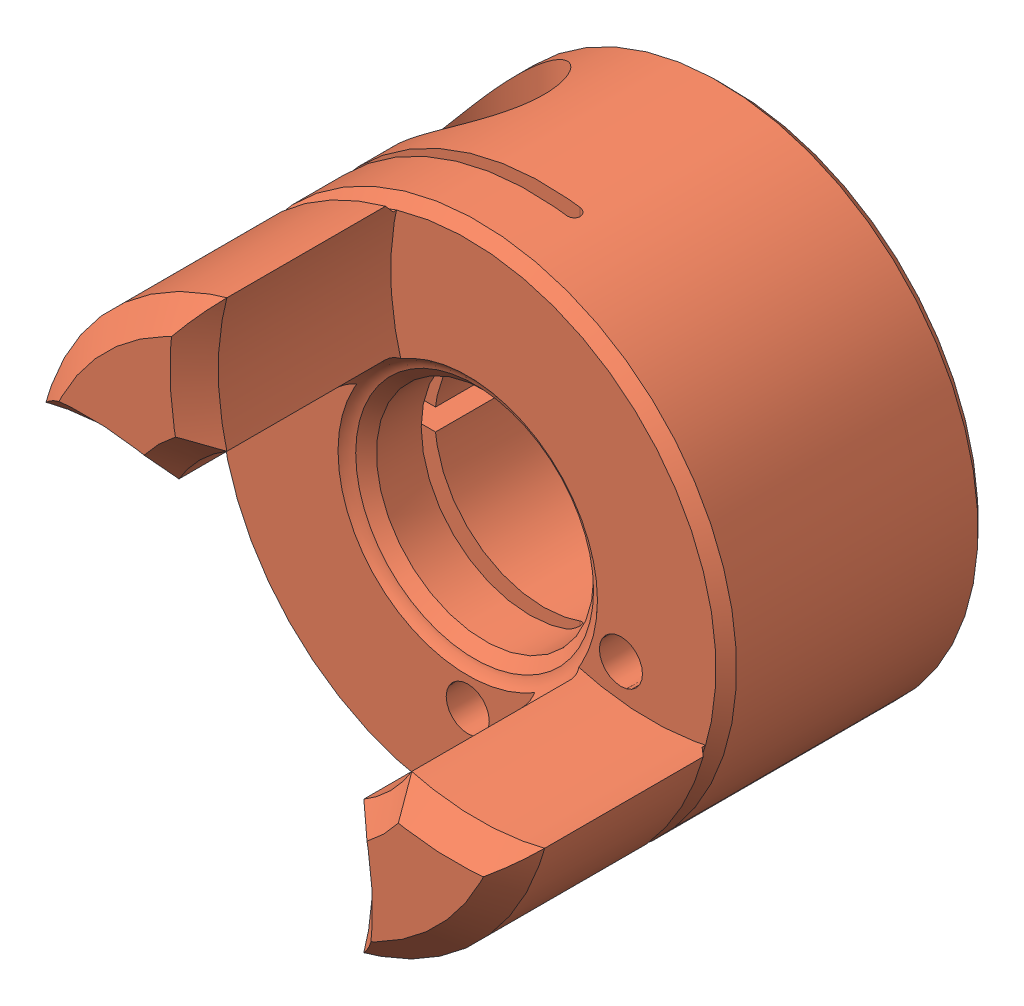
SolidWorks assembly MJC19-8-A.SLDASM, configuration Default (file format 13000). Lengths in mm.
Overall size (19.05 19.05 16.89).
2 component instances, 2 part files, 0 mates.
Components (placement in the parent):
- MJC19-8-A_Vis-1: MJC19-8-A_Vis.SLDPRT [Default] at origin size (4.5 10.5 4.5)
- MJC19-8-A-1: MJC19-8-A.SLDPRT [Default] at origin size (19.05 19.05 16.89)
